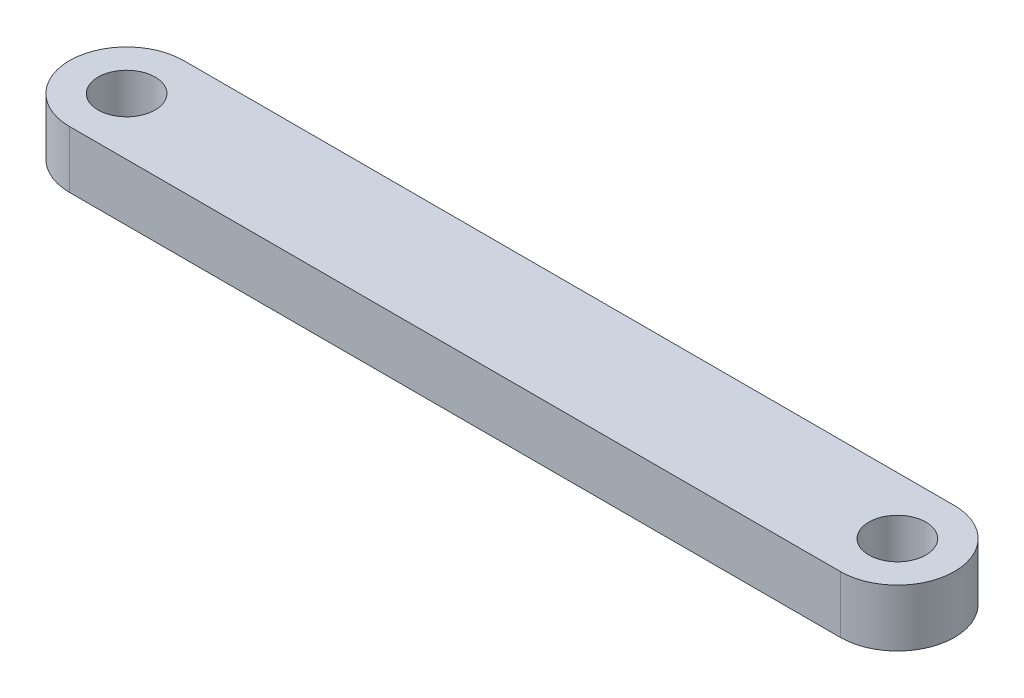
from build123d import *

# Parameters (mm, degrees)
SKETCH1_R           = 50
BOSS_EXTRUDE1_DEPTH = 50


with BuildPart() as part:
    # Sketch1 → Boss-Extrude1 (new, symmetric)
    with BuildSketch(Plane(origin=(0, 0, 0), x_dir=(1, 0, 0), z_dir=(0, 1, 0))):
        with BuildLine():
            Line((-675, 100), (675, 100))
            ThreePointArc((675, 100), (775, 0), (675, -100))
            Line((675, -100), (-675, -100))
            ThreePointArc((-675, -100), (-775, 0), (-675, 100))
        make_face()
        with Locations(Location((-675, 0, 0), (0, 0, 270))):
            Circle(SKETCH1_R, mode=Mode.SUBTRACT)
        with Locations(Location((675, 0, 0), (0, 0, 270))):
            Circle(SKETCH1_R, mode=Mode.SUBTRACT)
    extrude(amount=BOSS_EXTRUDE1_DEPTH, both=True)


solid = part.part
